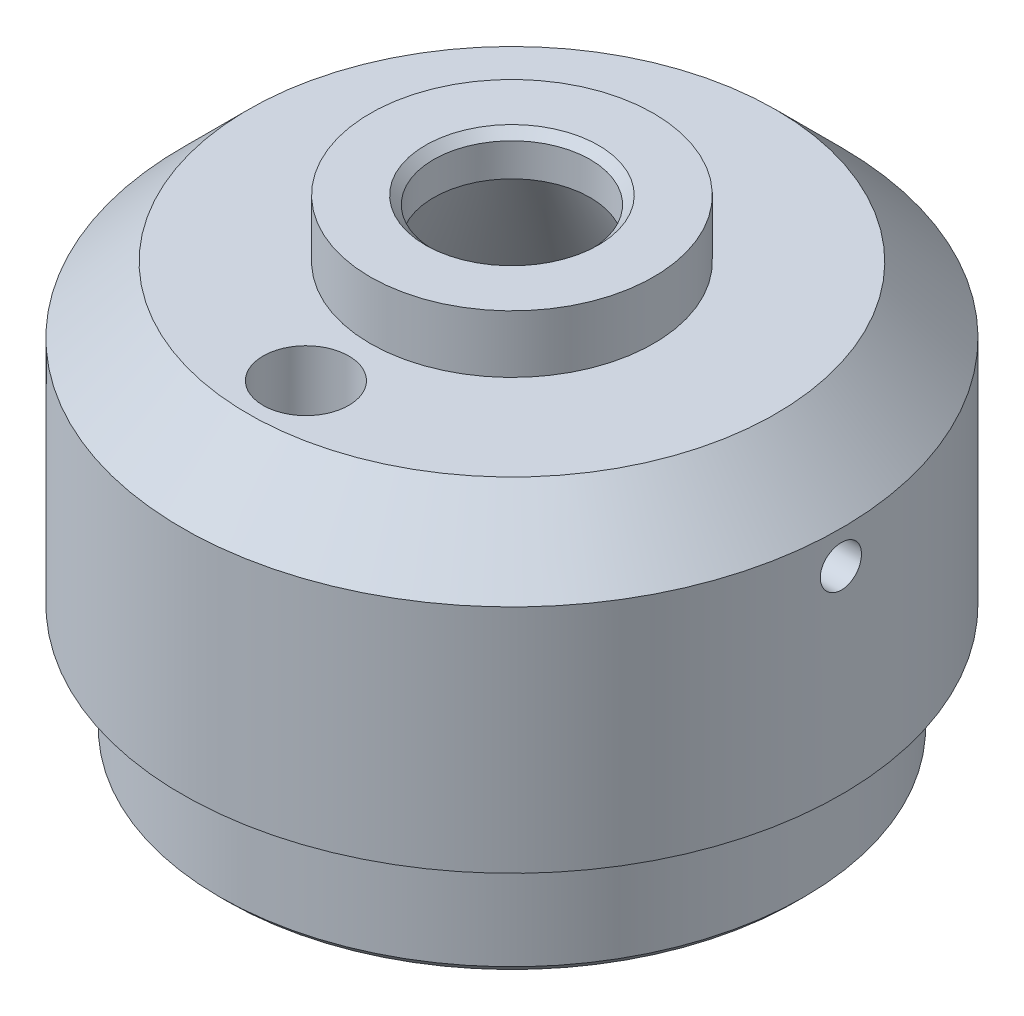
ISO-10303-21;
HEADER;
FILE_DESCRIPTION(('STEP AP214'),'2;1');
FILE_NAME('part.step','',(''),(''),'','','');
FILE_SCHEMA(('AUTOMOTIVE_DESIGN { 1 0 10303 214 1 1 1 1 }'));
ENDSEC;
DATA;
#1=APPLICATION_CONTEXT('core data for automotive mechanical design processes');
#2=APPLICATION_PROTOCOL_DEFINITION('international standard','automotive_design',2000,#1);
#3=PRODUCT_CONTEXT('',#1,'mechanical');
#4=PRODUCT('Part','Part','',(#3));
#5=PRODUCT_RELATED_PRODUCT_CATEGORY('part','',(#4));
#6=PRODUCT_DEFINITION_FORMATION('','',#4);
#7=PRODUCT_DEFINITION_CONTEXT('part definition',#1,'design');
#8=PRODUCT_DEFINITION('design','',#6,#7);
#9=PRODUCT_DEFINITION_SHAPE('','',#8);
#10=(LENGTH_UNIT() NAMED_UNIT(*) SI_UNIT(.MILLI.,.METRE.));
#11=(NAMED_UNIT(*) PLANE_ANGLE_UNIT() SI_UNIT($,.RADIAN.));
#12=(NAMED_UNIT(*) SI_UNIT($,.STERADIAN.) SOLID_ANGLE_UNIT());
#13=UNCERTAINTY_MEASURE_WITH_UNIT(LENGTH_MEASURE(1.E-05),#10,'distance_accuracy_value','');
#14=(GEOMETRIC_REPRESENTATION_CONTEXT(3) GLOBAL_UNCERTAINTY_ASSIGNED_CONTEXT((#13)) GLOBAL_UNIT_ASSIGNED_CONTEXT((#10,
#11,#12)) REPRESENTATION_CONTEXT('',''));
#15=CARTESIAN_POINT('',(0.,0.,0.));
#16=DIRECTION('',(0.,0.,1.));
#17=DIRECTION('',(1.,0.,0.));
#18=AXIS2_PLACEMENT_3D('',#15,#16,#17);
#19=CARTESIAN_POINT('',(0.,0.,0.));
#20=DIRECTION('',(0.,-1.,0.));
#21=DIRECTION('',(0.,0.,-1.));
#22=AXIS2_PLACEMENT_3D('',#19,#20,#21);
#23=CYLINDRICAL_SURFACE('',#22,17.75);
#24=CARTESIAN_POINT('',(0.,0.500000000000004,0.));
#25=DIRECTION('',(0.,-1.,0.));
#26=DIRECTION('',(0.,0.,-1.));
#27=AXIS2_PLACEMENT_3D('',#24,#25,#26);
#28=CIRCLE('',#27,17.75);
#29=CARTESIAN_POINT('',(0.,0.500000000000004,-17.75));
#30=VERTEX_POINT('',#29);
#31=EDGE_CURVE('E123',#30,#30,#28,.F.);
#32=ORIENTED_EDGE('',*,*,#31,.T.);
#33=EDGE_LOOP('',(#32));
#34=FACE_BOUND('',#33,.T.);
#35=CARTESIAN_POINT('',(0.,7.,0.));
#36=DIRECTION('',(0.,-1.,0.));
#37=DIRECTION('',(0.,0.,-1.));
#38=AXIS2_PLACEMENT_3D('',#35,#36,#37);
#39=CIRCLE('',#38,17.75);
#40=CARTESIAN_POINT('',(0.,7.,-17.75));
#41=VERTEX_POINT('',#40);
#42=EDGE_CURVE('E93',#41,#41,#39,.T.);
#43=ORIENTED_EDGE('',*,*,#42,.T.);
#44=EDGE_LOOP('',(#43));
#45=FACE_BOUND('',#44,.T.);
#46=ADVANCED_FACE('F36',(#34,#45),#23,.T.);
#47=CARTESIAN_POINT('',(16.25,0.,0.));
#48=DIRECTION('',(0.,-1.,0.));
#49=DIRECTION('',(0.,0.,-1.));
#50=AXIS2_PLACEMENT_3D('',#47,#48,#49);
#51=PLANE('',#50);
#52=CARTESIAN_POINT('',(0.,0.,0.));
#53=DIRECTION('',(0.,-1.,0.));
#54=DIRECTION('',(0.,0.,-1.));
#55=AXIS2_PLACEMENT_3D('',#52,#53,#54);
#56=CIRCLE('',#55,17.25);
#57=CARTESIAN_POINT('',(0.,0.,-17.25));
#58=VERTEX_POINT('',#57);
#59=EDGE_CURVE('E120',#58,#58,#56,.T.);
#60=ORIENTED_EDGE('',*,*,#59,.T.);
#61=EDGE_LOOP('',(#60));
#62=FACE_BOUND('',#61,.T.);
#63=CARTESIAN_POINT('',(0.,0.,0.));
#64=DIRECTION('',(0.,-1.,0.));
#65=DIRECTION('',(0.,0.,-1.));
#66=AXIS2_PLACEMENT_3D('',#63,#64,#65);
#67=CIRCLE('',#66,16.25);
#68=CARTESIAN_POINT('',(0.,0.,-16.25));
#69=VERTEX_POINT('',#68);
#70=EDGE_CURVE('E117',#69,#69,#67,.T.);
#71=ORIENTED_EDGE('',*,*,#70,.F.);
#72=EDGE_LOOP('',(#71));
#73=FACE_BOUND('',#72,.T.);
#74=ADVANCED_FACE('F170',(#62,#73),#51,.T.);
#75=CARTESIAN_POINT('',(0.,0.,0.));
#76=DIRECTION('',(0.,-1.,0.));
#77=DIRECTION('',(0.,0.,-1.));
#78=AXIS2_PLACEMENT_3D('',#75,#76,#77);
#79=CYLINDRICAL_SURFACE('',#78,16.25);
#80=ORIENTED_EDGE('',*,*,#70,.T.);
#81=EDGE_LOOP('',(#80));
#82=FACE_BOUND('',#81,.T.);
#83=CARTESIAN_POINT('',(0.,3.2,0.));
#84=DIRECTION('',(0.,-1.,0.));
#85=DIRECTION('',(0.,0.,-1.));
#86=AXIS2_PLACEMENT_3D('',#83,#84,#85);
#87=CIRCLE('',#86,16.25);
#88=CARTESIAN_POINT('',(0.,3.2,-16.25));
#89=VERTEX_POINT('',#88);
#90=EDGE_CURVE('E114',#89,#89,#87,.T.);
#91=ORIENTED_EDGE('',*,*,#90,.F.);
#92=EDGE_LOOP('',(#91));
#93=FACE_BOUND('',#92,.T.);
#94=ADVANCED_FACE('F175',(#82,#93),#79,.F.);
#95=CARTESIAN_POINT('',(0.,26.,0.));
#96=DIRECTION('',(0.,-1.,0.));
#97=DIRECTION('',(0.,0.,-1.));
#98=AXIS2_PLACEMENT_3D('',#95,#96,#97);
#99=CONICAL_SURFACE('',#98,4.75,0.467150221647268);
#100=CARTESIAN_POINT('',(0.,26.,0.));
#101=DIRECTION('',(0.,-1.,0.));
#102=DIRECTION('',(0.,0.,-1.));
#103=AXIS2_PLACEMENT_3D('',#100,#101,#102);
#104=CIRCLE('',#103,4.75);
#105=CARTESIAN_POINT('',(0.,26.,-4.75));
#106=VERTEX_POINT('',#105);
#107=EDGE_CURVE('E111',#106,#106,#104,.T.);
#108=CARTESIAN_POINT('',(0.,3.2,-16.25));
#109=CARTESIAN_POINT('',(0.,3.4375,-16.1302083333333));
#110=CARTESIAN_POINT('',(0.,3.675,-16.0104166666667));
#111=CARTESIAN_POINT('',(0.,4.15,-15.7708333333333));
#112=CARTESIAN_POINT('',(0.,4.3875,-15.6510416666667));
#113=CARTESIAN_POINT('',(0.,4.8625,-15.4114583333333));
#114=CARTESIAN_POINT('',(0.,5.1,-15.2916666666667));
#115=CARTESIAN_POINT('',(0.,5.575,-15.0520833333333));
#116=CARTESIAN_POINT('',(0.,5.8125,-14.9322916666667));
#117=CARTESIAN_POINT('',(0.,6.2875,-14.6927083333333));
#118=CARTESIAN_POINT('',(0.,6.525,-14.5729166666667));
#119=CARTESIAN_POINT('',(0.,7.,-14.3333333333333));
#120=CARTESIAN_POINT('',(0.,7.2375,-14.2135416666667));
#121=CARTESIAN_POINT('',(0.,7.7125,-13.9739583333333));
#122=CARTESIAN_POINT('',(0.,7.95,-13.8541666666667));
#123=CARTESIAN_POINT('',(0.,8.425,-13.6145833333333));
#124=CARTESIAN_POINT('',(0.,8.6625,-13.4947916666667));
#125=CARTESIAN_POINT('',(0.,9.1375,-13.2552083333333));
#126=CARTESIAN_POINT('',(0.,9.375,-13.1354166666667));
#127=CARTESIAN_POINT('',(0.,9.85,-12.8958333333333));
#128=CARTESIAN_POINT('',(0.,10.0875,-12.7760416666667));
#129=CARTESIAN_POINT('',(0.,10.5625,-12.5364583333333));
#130=CARTESIAN_POINT('',(0.,10.8,-12.4166666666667));
#131=CARTESIAN_POINT('',(0.,11.275,-12.1770833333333));
#132=CARTESIAN_POINT('',(0.,11.5125,-12.0572916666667));
#133=CARTESIAN_POINT('',(0.,11.9875,-11.8177083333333));
#134=CARTESIAN_POINT('',(0.,12.225,-11.6979166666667));
#135=CARTESIAN_POINT('',(0.,12.7,-11.4583333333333));
#136=CARTESIAN_POINT('',(0.,12.9375,-11.3385416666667));
#137=CARTESIAN_POINT('',(0.,13.4125,-11.0989583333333));
#138=CARTESIAN_POINT('',(0.,13.65,-10.9791666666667));
#139=CARTESIAN_POINT('',(0.,14.125,-10.7395833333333));
#140=CARTESIAN_POINT('',(0.,14.3625,-10.6197916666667));
#141=CARTESIAN_POINT('',(0.,14.8375,-10.3802083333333));
#142=CARTESIAN_POINT('',(0.,15.075,-10.2604166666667));
#143=CARTESIAN_POINT('',(0.,15.55,-10.0208333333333));
#144=CARTESIAN_POINT('',(0.,15.7875,-9.90104166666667));
#145=CARTESIAN_POINT('',(0.,16.2625,-9.66145833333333));
#146=CARTESIAN_POINT('',(0.,16.5,-9.54166666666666));
#147=CARTESIAN_POINT('',(0.,16.975,-9.30208333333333));
#148=CARTESIAN_POINT('',(0.,17.2125,-9.18229166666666));
#149=CARTESIAN_POINT('',(0.,17.6875,-8.94270833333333));
#150=CARTESIAN_POINT('',(0.,17.925,-8.82291666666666));
#151=CARTESIAN_POINT('',(0.,18.4,-8.58333333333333));
#152=CARTESIAN_POINT('',(0.,18.6375,-8.46354166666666));
#153=CARTESIAN_POINT('',(0.,19.1125,-8.22395833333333));
#154=CARTESIAN_POINT('',(0.,19.35,-8.10416666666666));
#155=CARTESIAN_POINT('',(0.,19.825,-7.86458333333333));
#156=CARTESIAN_POINT('',(0.,20.0625,-7.74479166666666));
#157=CARTESIAN_POINT('',(0.,20.5375,-7.50520833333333));
#158=CARTESIAN_POINT('',(0.,20.775,-7.38541666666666));
#159=CARTESIAN_POINT('',(0.,21.25,-7.14583333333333));
#160=CARTESIAN_POINT('',(0.,21.4875,-7.02604166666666));
#161=CARTESIAN_POINT('',(0.,21.9625,-6.78645833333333));
#162=CARTESIAN_POINT('',(0.,22.2,-6.66666666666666));
#163=CARTESIAN_POINT('',(0.,22.675,-6.42708333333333));
#164=CARTESIAN_POINT('',(0.,22.9125,-6.30729166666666));
#165=CARTESIAN_POINT('',(0.,23.3875,-6.06770833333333));
#166=CARTESIAN_POINT('',(0.,23.625,-5.94791666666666));
#167=CARTESIAN_POINT('',(0.,24.1,-5.70833333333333));
#168=CARTESIAN_POINT('',(0.,24.3375,-5.58854166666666));
#169=CARTESIAN_POINT('',(0.,24.8125,-5.34895833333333));
#170=CARTESIAN_POINT('',(0.,25.05,-5.22916666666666));
#171=CARTESIAN_POINT('',(0.,25.525,-4.98958333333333));
#172=CARTESIAN_POINT('',(0.,25.7625,-4.86979166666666));
#173=CARTESIAN_POINT('',(0.,26.,-4.75));
#174=B_SPLINE_CURVE_WITH_KNOTS('',3,(#108,#109,#110,#111,#112,#113,#114,#115,#116,#117,#118,
#119,#120,#121,#122,#123,#124,#125,#126,#127,#128,#129,#130,#131,#132,#133,#134,#135,#136,#137,
#138,#139,#140,#141,#142,#143,#144,#145,#146,#147,#148,#149,#150,#151,#152,#153,#154,#155,#156,
#157,#158,#159,#160,#161,#162,#163,#164,#165,#166,#167,#168,#169,#170,#171,#172,#173),
.UNSPECIFIED.,.F.,.F.,(4,2,2,2,2,2,2,2,2,2,2,2,2,2,2,2,2,2,2,2,2,2,2,2,2,2,2,2,2,2,2,2,4),(0.,
0.798001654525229,1.59600330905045,2.39400496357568,3.19200661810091,3.99000827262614,
4.78800992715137,5.58601158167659,6.38401323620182,7.18201489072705,7.98001654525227,
8.7780181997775,9.57601985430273,10.374021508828,11.1720231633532,11.9700248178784,
12.7680264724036,13.5660281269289,14.3640297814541,15.1620314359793,15.9600330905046,
16.7580347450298,17.556036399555,18.3540380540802,19.1520397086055,19.9500413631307,
20.7480430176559,21.5460446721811,22.3440463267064,23.1420479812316,23.9400496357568,
24.7380512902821,25.5360529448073),.UNSPECIFIED.);
#175=EDGE_CURVE('BSEAM187',#89,#106,#174,.T.);
#176=ORIENTED_EDGE('',*,*,#90,.T.);
#177=ORIENTED_EDGE('',*,*,#107,.F.);
#178=ORIENTED_EDGE('',*,*,#175,.T.);
#179=ORIENTED_EDGE('',*,*,#175,.F.);
#180=EDGE_LOOP('',(#176,#178,#177,#179));
#181=FACE_BOUND('',#180,.T.);
#182=ADVANCED_FACE('F187',(#181),#99,.F.);
#183=CARTESIAN_POINT('',(0.,0.,0.));
#184=DIRECTION('',(0.,-1.,0.));
#185=DIRECTION('',(0.,0.,-1.));
#186=AXIS2_PLACEMENT_3D('',#183,#184,#185);
#187=CYLINDRICAL_SURFACE('',#186,4.75);
#188=CARTESIAN_POINT('',(0.,28.,0.));
#189=DIRECTION('',(0.,1.,0.));
#190=DIRECTION('',(0.,0.,1.));
#191=AXIS2_PLACEMENT_3D('',#188,#189,#190);
#192=CIRCLE('',#191,4.75);
#193=CARTESIAN_POINT('',(0.,28.,4.75));
#194=VERTEX_POINT('',#193);
#195=EDGE_CURVE('E129',#194,#194,#192,.T.);
#196=ORIENTED_EDGE('',*,*,#195,.T.);
#197=EDGE_LOOP('',(#196));
#198=FACE_BOUND('',#197,.T.);
#199=ORIENTED_EDGE('',*,*,#107,.T.);
#200=EDGE_LOOP('',(#199));
#201=FACE_BOUND('',#200,.T.);
#202=ADVANCED_FACE('F193',(#198,#201),#187,.F.);
#203=CARTESIAN_POINT('',(8.59999999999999,28.5,0.));
#204=DIRECTION('',(0.,1.,0.));
#205=DIRECTION('',(0.,0.,1.));
#206=AXIS2_PLACEMENT_3D('',#203,#204,#205);
#207=PLANE('',#206);
#208=CARTESIAN_POINT('',(0.,28.5,0.));
#209=DIRECTION('',(0.,1.,0.));
#210=DIRECTION('',(0.,0.,1.));
#211=AXIS2_PLACEMENT_3D('',#208,#209,#210);
#212=CIRCLE('',#211,5.25000000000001);
#213=CARTESIAN_POINT('',(0.,28.5,5.25000000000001));
#214=VERTEX_POINT('',#213);
#215=EDGE_CURVE('E126',#214,#214,#212,.F.);
#216=ORIENTED_EDGE('',*,*,#215,.T.);
#217=EDGE_LOOP('',(#216));
#218=FACE_BOUND('',#217,.T.);
#219=CARTESIAN_POINT('',(0.,28.5,0.));
#220=DIRECTION('',(0.,-1.,0.));
#221=DIRECTION('',(0.,0.,-1.));
#222=AXIS2_PLACEMENT_3D('',#219,#220,#221);
#223=CIRCLE('',#222,8.6);
#224=CARTESIAN_POINT('',(0.,28.5,-8.6));
#225=VERTEX_POINT('',#224);
#226=EDGE_CURVE('E108',#225,#225,#223,.T.);
#227=ORIENTED_EDGE('',*,*,#226,.F.);
#228=EDGE_LOOP('',(#227));
#229=FACE_BOUND('',#228,.T.);
#230=ADVANCED_FACE('F198',(#218,#229),#207,.T.);
#231=CARTESIAN_POINT('',(0.,0.,0.));
#232=DIRECTION('',(0.,-1.,0.));
#233=DIRECTION('',(0.,0.,-1.));
#234=AXIS2_PLACEMENT_3D('',#231,#232,#233);
#235=CYLINDRICAL_SURFACE('',#234,8.6);
#236=ORIENTED_EDGE('',*,*,#226,.T.);
#237=EDGE_LOOP('',(#236));
#238=FACE_BOUND('',#237,.T.);
#239=CARTESIAN_POINT('',(0.,25.,0.));
#240=DIRECTION('',(0.,-1.,0.));
#241=DIRECTION('',(0.,0.,-1.));
#242=AXIS2_PLACEMENT_3D('',#239,#240,#241);
#243=CIRCLE('',#242,8.6);
#244=CARTESIAN_POINT('',(0.,25.,-8.6));
#245=VERTEX_POINT('',#244);
#246=EDGE_CURVE('E105',#245,#245,#243,.T.);
#247=ORIENTED_EDGE('',*,*,#246,.F.);
#248=EDGE_LOOP('',(#247));
#249=FACE_BOUND('',#248,.T.);
#250=ADVANCED_FACE('F204',(#238,#249),#235,.T.);
#251=CARTESIAN_POINT('',(16.,25.,0.));
#252=DIRECTION('',(0.,1.,0.));
#253=DIRECTION('',(0.,0.,1.));
#254=AXIS2_PLACEMENT_3D('',#251,#252,#253);
#255=PLANE('',#254);
#256=CARTESIAN_POINT('',(0.,25.,12.5));
#257=DIRECTION('',(0.,1.,0.));
#258=DIRECTION('',(0.,0.,1.));
#259=AXIS2_PLACEMENT_3D('',#256,#257,#258);
#260=CIRCLE('',#259,2.6);
#261=CARTESIAN_POINT('',(0.,25.,15.1));
#262=VERTEX_POINT('',#261);
#263=EDGE_CURVE('E90',#262,#262,#260,.T.);
#264=ORIENTED_EDGE('',*,*,#263,.F.);
#265=EDGE_LOOP('',(#264));
#266=FACE_BOUND('',#265,.T.);
#267=ORIENTED_EDGE('',*,*,#246,.T.);
#268=EDGE_LOOP('',(#267));
#269=FACE_BOUND('',#268,.T.);
#270=CARTESIAN_POINT('',(0.,25.,0.));
#271=DIRECTION('',(0.,-1.,0.));
#272=DIRECTION('',(0.,0.,-1.));
#273=AXIS2_PLACEMENT_3D('',#270,#271,#272);
#274=CIRCLE('',#273,16.);
#275=CARTESIAN_POINT('',(0.,25.,-16.));
#276=VERTEX_POINT('',#275);
#277=EDGE_CURVE('E102',#276,#276,#274,.T.);
#278=ORIENTED_EDGE('',*,*,#277,.F.);
#279=EDGE_LOOP('',(#278));
#280=FACE_BOUND('',#279,.T.);
#281=ADVANCED_FACE('F210',(#266,#269,#280),#255,.T.);
#282=CARTESIAN_POINT('',(0.,21.,0.));
#283=DIRECTION('',(0.,-1.,0.));
#284=DIRECTION('',(0.,0.,-1.));
#285=AXIS2_PLACEMENT_3D('',#282,#283,#284);
#286=CONICAL_SURFACE('',#285,20.,0.785398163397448);
#287=ORIENTED_EDGE('',*,*,#277,.T.);
#288=EDGE_LOOP('',(#287));
#289=FACE_BOUND('',#288,.T.);
#290=CARTESIAN_POINT('',(0.,21.,0.));
#291=DIRECTION('',(0.,-1.,0.));
#292=DIRECTION('',(0.,0.,-1.));
#293=AXIS2_PLACEMENT_3D('',#290,#291,#292);
#294=CIRCLE('',#293,20.);
#295=CARTESIAN_POINT('',(0.,21.,-20.));
#296=VERTEX_POINT('',#295);
#297=EDGE_CURVE('E99',#296,#296,#294,.T.);
#298=ORIENTED_EDGE('',*,*,#297,.F.);
#299=EDGE_LOOP('',(#298));
#300=FACE_BOUND('',#299,.T.);
#301=ADVANCED_FACE('F166',(#289,#300),#286,.T.);
#302=CARTESIAN_POINT('',(0.,0.,0.));
#303=DIRECTION('',(0.,-1.,0.));
#304=DIRECTION('',(0.,0.,-1.));
#305=AXIS2_PLACEMENT_3D('',#302,#303,#304);
#306=CYLINDRICAL_SURFACE('',#305,20.);
#307=CARTESIAN_POINT('',(-19.9608992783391,19.,1.24999999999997));
#308=CARTESIAN_POINT('',(-19.9608998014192,19.0701394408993,1.24999691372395));
#309=CARTESIAN_POINT('',(-19.96127294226,19.14032799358,1.24407671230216));
#310=CARTESIAN_POINT('',(-19.9627253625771,19.2787670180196,1.22054483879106));
#311=CARTESIAN_POINT('',(-19.9638054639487,19.3470151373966,1.20291955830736));
#312=CARTESIAN_POINT('',(-19.9665489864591,19.4795479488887,1.15648576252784));
#313=CARTESIAN_POINT('',(-19.9682120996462,19.5438347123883,1.12768315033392));
#314=CARTESIAN_POINT('',(-19.9719338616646,19.6666442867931,1.05972184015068));
#315=CARTESIAN_POINT('',(-19.9739924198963,19.7251684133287,1.02056551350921));
#316=CARTESIAN_POINT('',(-19.9782766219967,19.8348962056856,0.932943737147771));
#317=CARTESIAN_POINT('',(-19.9805024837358,19.8860900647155,0.884466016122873));
#318=CARTESIAN_POINT('',(-19.9848684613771,19.9796201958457,0.779602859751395));
#319=CARTESIAN_POINT('',(-19.9870085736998,20.021956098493,0.723217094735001));
#320=CARTESIAN_POINT('',(-19.9909637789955,20.0965984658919,0.6040833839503));
#321=CARTESIAN_POINT('',(-19.9927786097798,20.1288968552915,0.54133036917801));
#322=CARTESIAN_POINT('',(-19.9958764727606,20.1824956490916,0.411279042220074));
#323=CARTESIAN_POINT('',(-19.9971595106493,20.2037961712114,0.343980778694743));
#324=CARTESIAN_POINT('',(-19.9990477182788,20.234767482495,0.206843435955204));
#325=CARTESIAN_POINT('',(-19.9996537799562,20.2444535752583,0.137007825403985));
#326=CARTESIAN_POINT('',(-20.0001227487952,20.2519683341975,-0.00330049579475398));
#327=CARTESIAN_POINT('',(-19.9999856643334,20.2497971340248,-0.0737731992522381));
#328=CARTESIAN_POINT('',(-19.9989845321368,20.2336715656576,-0.213251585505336));
#329=CARTESIAN_POINT('',(-19.9981215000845,20.2197336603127,-0.282259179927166));
#330=CARTESIAN_POINT('',(-19.9957668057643,20.1804958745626,-0.416953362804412));
#331=CARTESIAN_POINT('',(-19.9942751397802,20.1551959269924,-0.482639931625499));
#332=CARTESIAN_POINT('',(-19.9908293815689,20.0939335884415,-0.608880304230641));
#333=CARTESIAN_POINT('',(-19.9888749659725,20.0579637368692,-0.669430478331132));
#334=CARTESIAN_POINT('',(-19.9847236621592,19.9763880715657,-0.783639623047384));
#335=CARTESIAN_POINT('',(-19.982526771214,19.9307821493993,-0.837298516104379));
#336=CARTESIAN_POINT('',(-19.9781333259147,19.8311359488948,-0.936298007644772));
#337=CARTESIAN_POINT('',(-19.9759367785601,19.7770813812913,-0.981624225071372));
#338=CARTESIAN_POINT('',(-19.9717954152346,19.662122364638,-1.06256083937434));
#339=CARTESIAN_POINT('',(-19.9698505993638,19.6012179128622,-1.09817123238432));
#340=CARTESIAN_POINT('',(-19.9664323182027,19.4742788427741,-1.15866432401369));
#341=CARTESIAN_POINT('',(-19.9649588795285,19.4082439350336,-1.18354641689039));
#342=CARTESIAN_POINT('',(-19.9626504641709,19.2729226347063,-1.22186666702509));
#343=CARTESIAN_POINT('',(-19.9618154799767,19.2036362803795,-1.23530495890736));
#344=CARTESIAN_POINT('',(-19.9608795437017,19.0639043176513,-1.25033822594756));
#345=CARTESIAN_POINT('',(-19.9607773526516,18.9934608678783,-1.25195319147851));
#346=CARTESIAN_POINT('',(-19.9613152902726,18.8533040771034,-1.2433461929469));
#347=CARTESIAN_POINT('',(-19.961955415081,18.7835907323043,-1.23312429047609));
#348=CARTESIAN_POINT('',(-19.9639047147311,18.6469295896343,-1.20115032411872));
#349=CARTESIAN_POINT('',(-19.9652133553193,18.5799796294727,-1.17940746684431));
#350=CARTESIAN_POINT('',(-19.9683517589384,18.4506789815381,-1.12501811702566));
#351=CARTESIAN_POINT('',(-19.9701815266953,18.3883283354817,-1.09237152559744));
#352=CARTESIAN_POINT('',(-19.9741589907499,18.2699043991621,-1.01705034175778));
#353=CARTESIAN_POINT('',(-19.9763071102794,18.2138396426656,-0.974362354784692));
#354=CARTESIAN_POINT('',(-19.9806777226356,18.1096649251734,-0.880189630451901));
#355=CARTESIAN_POINT('',(-19.9829002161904,18.0615550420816,-0.828704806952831));
#356=CARTESIAN_POINT('',(-19.9871727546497,17.9745882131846,-0.718313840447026));
#357=CARTESIAN_POINT('',(-19.9892225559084,17.9357442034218,-0.659397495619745));
#358=CARTESIAN_POINT('',(-19.9929152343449,17.8685002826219,-0.535867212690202));
#359=CARTESIAN_POINT('',(-19.9945581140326,17.8401003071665,-0.471253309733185));
#360=CARTESIAN_POINT('',(-19.9972506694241,17.794573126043,-0.338209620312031));
#361=CARTESIAN_POINT('',(-19.9983007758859,17.7774377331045,-0.269782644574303));
#362=CARTESIAN_POINT('',(-19.9996911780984,17.7548993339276,-0.131016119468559));
#363=CARTESIAN_POINT('',(-20.0000314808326,17.7494962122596,-0.0606765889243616));
#364=CARTESIAN_POINT('',(-19.9999639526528,17.7505768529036,0.0797903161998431));
#365=CARTESIAN_POINT('',(-19.9995573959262,17.757040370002,0.149917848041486));
#366=CARTESIAN_POINT('',(-19.9980443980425,17.7816288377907,0.288089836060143));
#367=CARTESIAN_POINT('',(-19.9969379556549,17.7997538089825,0.356134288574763));
#368=CARTESIAN_POINT('',(-19.994149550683,17.8471461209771,0.488211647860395));
#369=CARTESIAN_POINT('',(-19.9924675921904,17.8764133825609,0.552244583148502));
#370=CARTESIAN_POINT('',(-19.988717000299,17.9452566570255,0.674490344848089));
#371=CARTESIAN_POINT('',(-19.9866483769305,17.9848324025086,0.732703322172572));
#372=CARTESIAN_POINT('',(-19.982352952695,18.0732439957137,0.841759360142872));
#373=CARTESIAN_POINT('',(-19.9801259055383,18.1220944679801,0.89259055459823));
#374=CARTESIAN_POINT('',(-19.9757665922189,18.2276494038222,0.985348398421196));
#375=CARTESIAN_POINT('',(-19.9736343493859,18.2843557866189,1.02727286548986));
#376=CARTESIAN_POINT('',(-19.9697031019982,18.404077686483,1.10105823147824));
#377=CARTESIAN_POINT('',(-19.9679045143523,18.4671009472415,1.13290657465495));
#378=CARTESIAN_POINT('',(-19.9648495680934,18.5975656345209,1.18553070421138));
#379=CARTESIAN_POINT('',(-19.963592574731,18.6650017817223,1.20631945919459));
#380=CARTESIAN_POINT('',(-19.9620925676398,18.777375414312,1.23083110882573));
#381=CARTESIAN_POINT('',(-19.9616470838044,18.8215865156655,1.23801014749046));
#382=CARTESIAN_POINT('',(-19.9610502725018,18.9105250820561,1.24759557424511));
#383=CARTESIAN_POINT('',(-19.9608989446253,18.9552525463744,1.25000196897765));
#384=CARTESIAN_POINT('',(-19.9608992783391,19.,1.24999999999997));
#385=B_SPLINE_CURVE_WITH_KNOTS('',3,(#307,#308,#309,#310,#311,#312,#313,#314,#315,#316,#317,
#318,#319,#320,#321,#322,#323,#324,#325,#326,#327,#328,#329,#330,#331,#332,#333,#334,#335,#336,
#337,#338,#339,#340,#341,#342,#343,#344,#345,#346,#347,#348,#349,#350,#351,#352,#353,#354,#355,
#356,#357,#358,#359,#360,#361,#362,#363,#364,#365,#366,#367,#368,#369,#370,#371,#372,#373,#374,
#375,#376,#377,#378,#379,#380,#381,#382,#383,#384),.UNSPECIFIED.,.T.,.F.,(4,2,2,2,2,2,2,2,2,2,2,
2,2,2,2,2,2,2,2,2,2,2,2,2,2,2,2,2,2,2,2,2,2,2,2,2,2,2,4),(0.,0.210254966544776,
0.420754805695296,0.631143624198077,0.841484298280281,1.05210379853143,1.2627320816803,
1.47352938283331,1.68432442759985,1.8948414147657,2.1053560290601,2.31557659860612,
2.52579841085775,2.73616756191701,2.94653908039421,3.15727033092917,3.36800166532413,
3.57874489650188,3.78948564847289,3.99987000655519,4.21025326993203,4.42046866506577,
4.63068596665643,4.84118529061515,5.05168667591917,5.26248024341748,5.47327251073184,
5.68391140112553,5.89454821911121,6.1048260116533,6.31510417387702,6.52538084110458,
6.73565205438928,6.94625762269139,7.15691473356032,7.3678333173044,7.57850402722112,
7.71264235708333,7.84678050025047),.UNSPECIFIED.);
#386=CARTESIAN_POINT('',(-20.,20.25,0.));
#387=VERTEX_POINT('',#386);
#388=CARTESIAN_POINT('',(-20.,17.75,0.));
#389=VERTEX_POINT('',#388);
#390=EDGE_CURVE('E13',#387,#389,#385,.T.);
#391=ORIENTED_EDGE('',*,*,#390,.F.);
#392=EDGE_CURVE('E39',#389,#387,#385,.T.);
#393=ORIENTED_EDGE('',*,*,#392,.F.);
#394=EDGE_LOOP('',(#391,#393));
#395=FACE_BOUND('',#394,.T.);
#396=CARTESIAN_POINT('',(19.9608992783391,19.,-1.24999999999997));
#397=CARTESIAN_POINT('',(19.9608998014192,19.0701394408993,-1.24999691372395));
#398=CARTESIAN_POINT('',(19.96127294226,19.14032799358,-1.24407671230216));
#399=CARTESIAN_POINT('',(19.9627253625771,19.2787670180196,-1.22054483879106));
#400=CARTESIAN_POINT('',(19.9638054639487,19.3470151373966,-1.20291955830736));
#401=CARTESIAN_POINT('',(19.9665489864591,19.4795479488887,-1.15648576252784));
#402=CARTESIAN_POINT('',(19.9682120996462,19.5438347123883,-1.12768315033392));
#403=CARTESIAN_POINT('',(19.9719338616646,19.6666442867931,-1.05972184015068));
#404=CARTESIAN_POINT('',(19.9739924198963,19.7251684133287,-1.02056551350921));
#405=CARTESIAN_POINT('',(19.9782766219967,19.8348962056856,-0.932943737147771));
#406=CARTESIAN_POINT('',(19.9805024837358,19.8860900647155,-0.884466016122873));
#407=CARTESIAN_POINT('',(19.9848684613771,19.9796201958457,-0.779602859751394));
#408=CARTESIAN_POINT('',(19.9870085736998,20.021956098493,-0.723217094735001));
#409=CARTESIAN_POINT('',(19.9909637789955,20.0965984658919,-0.6040833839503));
#410=CARTESIAN_POINT('',(19.9927786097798,20.1288968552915,-0.54133036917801));
#411=CARTESIAN_POINT('',(19.9958764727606,20.1824956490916,-0.411279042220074));
#412=CARTESIAN_POINT('',(19.9971595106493,20.2037961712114,-0.343980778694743));
#413=CARTESIAN_POINT('',(19.9990477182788,20.234767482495,-0.206843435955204));
#414=CARTESIAN_POINT('',(19.9996537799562,20.2444535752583,-0.137007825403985));
#415=CARTESIAN_POINT('',(20.0001227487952,20.2519683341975,0.00330049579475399));
#416=CARTESIAN_POINT('',(19.9999856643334,20.2497971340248,0.0737731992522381));
#417=CARTESIAN_POINT('',(19.9989845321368,20.2336715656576,0.213251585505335));
#418=CARTESIAN_POINT('',(19.9981215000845,20.2197336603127,0.282259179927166));
#419=CARTESIAN_POINT('',(19.9957668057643,20.1804958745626,0.416953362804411));
#420=CARTESIAN_POINT('',(19.9942751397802,20.1551959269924,0.482639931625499));
#421=CARTESIAN_POINT('',(19.990829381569,20.0939335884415,0.608880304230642));
#422=CARTESIAN_POINT('',(19.9888749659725,20.0579637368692,0.669430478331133));
#423=CARTESIAN_POINT('',(19.9847236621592,19.9763880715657,0.783639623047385));
#424=CARTESIAN_POINT('',(19.982526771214,19.9307821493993,0.837298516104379));
#425=CARTESIAN_POINT('',(19.9781333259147,19.8311359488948,0.936298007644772));
#426=CARTESIAN_POINT('',(19.9759367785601,19.7770813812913,0.981624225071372));
#427=CARTESIAN_POINT('',(19.9717954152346,19.662122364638,1.06256083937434));
#428=CARTESIAN_POINT('',(19.9698505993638,19.6012179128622,1.09817123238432));
#429=CARTESIAN_POINT('',(19.9664323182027,19.4742788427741,1.15866432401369));
#430=CARTESIAN_POINT('',(19.9649588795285,19.4082439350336,1.18354641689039));
#431=CARTESIAN_POINT('',(19.9626504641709,19.2729226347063,1.22186666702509));
#432=CARTESIAN_POINT('',(19.9618154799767,19.2036362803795,1.23530495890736));
#433=CARTESIAN_POINT('',(19.9608795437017,19.0639043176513,1.25033822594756));
#434=CARTESIAN_POINT('',(19.9607773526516,18.9934608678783,1.25195319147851));
#435=CARTESIAN_POINT('',(19.9613152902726,18.8533040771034,1.2433461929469));
#436=CARTESIAN_POINT('',(19.961955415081,18.7835907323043,1.23312429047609));
#437=CARTESIAN_POINT('',(19.9639047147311,18.6469295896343,1.20115032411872));
#438=CARTESIAN_POINT('',(19.9652133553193,18.5799796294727,1.17940746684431));
#439=CARTESIAN_POINT('',(19.9683517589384,18.4506789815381,1.12501811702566));
#440=CARTESIAN_POINT('',(19.9701815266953,18.3883283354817,1.09237152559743));
#441=CARTESIAN_POINT('',(19.9741589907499,18.2699043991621,1.01705034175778));
#442=CARTESIAN_POINT('',(19.9763071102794,18.2138396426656,0.974362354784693));
#443=CARTESIAN_POINT('',(19.9806777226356,18.1096649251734,0.880189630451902));
#444=CARTESIAN_POINT('',(19.9829002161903,18.0615550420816,0.82870480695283));
#445=CARTESIAN_POINT('',(19.9871727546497,17.9745882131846,0.718313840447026));
#446=CARTESIAN_POINT('',(19.9892225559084,17.9357442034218,0.659397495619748));
#447=CARTESIAN_POINT('',(19.9929152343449,17.8685002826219,0.535867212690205));
#448=CARTESIAN_POINT('',(19.9945581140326,17.8401003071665,0.471253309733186));
#449=CARTESIAN_POINT('',(19.9972506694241,17.794573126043,0.33820962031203));
#450=CARTESIAN_POINT('',(19.9983007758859,17.7774377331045,0.269782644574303));
#451=CARTESIAN_POINT('',(19.9996911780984,17.7548993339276,0.13101611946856));
#452=CARTESIAN_POINT('',(20.0000314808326,17.7494962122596,0.0606765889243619));
#453=CARTESIAN_POINT('',(19.9999639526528,17.7505768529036,-0.0797903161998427));
#454=CARTESIAN_POINT('',(19.9995573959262,17.757040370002,-0.149917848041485));
#455=CARTESIAN_POINT('',(19.9980443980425,17.7816288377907,-0.288089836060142));
#456=CARTESIAN_POINT('',(19.9969379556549,17.7997538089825,-0.356134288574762));
#457=CARTESIAN_POINT('',(19.994149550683,17.8471461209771,-0.488211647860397));
#458=CARTESIAN_POINT('',(19.9924675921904,17.8764133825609,-0.552244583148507));
#459=CARTESIAN_POINT('',(19.988717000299,17.9452566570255,-0.674490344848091));
#460=CARTESIAN_POINT('',(19.9866483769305,17.9848324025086,-0.732703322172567));
#461=CARTESIAN_POINT('',(19.9823529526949,18.0732439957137,-0.841759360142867));
#462=CARTESIAN_POINT('',(19.9801259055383,18.1220944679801,-0.892590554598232));
#463=CARTESIAN_POINT('',(19.9757665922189,18.2276494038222,-0.985348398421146));
#464=CARTESIAN_POINT('',(19.9736343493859,18.2843557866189,-1.02727286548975));
#465=CARTESIAN_POINT('',(19.9697031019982,18.404077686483,-1.10105823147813));
#466=CARTESIAN_POINT('',(19.9679045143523,18.4671009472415,-1.13290657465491));
#467=CARTESIAN_POINT('',(19.9648495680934,18.5975656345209,-1.1855307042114));
#468=CARTESIAN_POINT('',(19.963592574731,18.6650017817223,-1.2063194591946));
#469=CARTESIAN_POINT('',(19.9620925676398,18.777375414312,-1.23083110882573));
#470=CARTESIAN_POINT('',(19.9616470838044,18.8215865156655,-1.23801014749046));
#471=CARTESIAN_POINT('',(19.9610502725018,18.9105250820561,-1.24759557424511));
#472=CARTESIAN_POINT('',(19.9608989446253,18.9552525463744,-1.25000196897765));
#473=CARTESIAN_POINT('',(19.9608992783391,19.,-1.24999999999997));
#474=B_SPLINE_CURVE_WITH_KNOTS('',3,(#396,#397,#398,#399,#400,#401,#402,#403,#404,#405,#406,
#407,#408,#409,#410,#411,#412,#413,#414,#415,#416,#417,#418,#419,#420,#421,#422,#423,#424,#425,
#426,#427,#428,#429,#430,#431,#432,#433,#434,#435,#436,#437,#438,#439,#440,#441,#442,#443,#444,
#445,#446,#447,#448,#449,#450,#451,#452,#453,#454,#455,#456,#457,#458,#459,#460,#461,#462,#463,
#464,#465,#466,#467,#468,#469,#470,#471,#472,#473),.UNSPECIFIED.,.T.,.F.,(4,2,2,2,2,2,2,2,2,2,2,
2,2,2,2,2,2,2,2,2,2,2,2,2,2,2,2,2,2,2,2,2,2,2,2,2,2,2,4),(0.,0.210254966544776,
0.420754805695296,0.631143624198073,0.841484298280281,1.05210379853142,1.2627320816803,
1.47352938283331,1.68432442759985,1.8948414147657,2.1053560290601,2.31557659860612,
2.52579841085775,2.73616756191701,2.94653908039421,3.15727033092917,3.36800166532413,
3.57874489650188,3.78948564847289,3.99987000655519,4.21025326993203,4.42046866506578,
4.63068596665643,4.84118529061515,5.05168667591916,5.26248024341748,5.47327251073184,
5.68391140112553,5.89454821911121,6.1048260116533,6.31510417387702,6.52538084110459,
6.73565205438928,6.94625762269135,7.15691473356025,7.36783331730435,7.5785040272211,
7.71264235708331,7.84678050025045),.UNSPECIFIED.);
#475=CARTESIAN_POINT('',(20.,20.25,0.));
#476=VERTEX_POINT('',#475);
#477=CARTESIAN_POINT('',(20.,17.75,0.));
#478=VERTEX_POINT('',#477);
#479=EDGE_CURVE('E58',#476,#478,#474,.T.);
#480=ORIENTED_EDGE('',*,*,#479,.F.);
#481=EDGE_CURVE('E131',#478,#476,#474,.T.);
#482=ORIENTED_EDGE('',*,*,#481,.F.);
#483=EDGE_LOOP('',(#480,#482));
#484=FACE_BOUND('',#483,.T.);
#485=ORIENTED_EDGE('',*,*,#297,.T.);
#486=EDGE_LOOP('',(#485));
#487=FACE_BOUND('',#486,.T.);
#488=CARTESIAN_POINT('',(0.,7.,0.));
#489=DIRECTION('',(0.,-1.,0.));
#490=DIRECTION('',(0.,0.,-1.));
#491=AXIS2_PLACEMENT_3D('',#488,#489,#490);
#492=CIRCLE('',#491,20.);
#493=CARTESIAN_POINT('',(0.,7.,-20.));
#494=VERTEX_POINT('',#493);
#495=EDGE_CURVE('E96',#494,#494,#492,.T.);
#496=ORIENTED_EDGE('',*,*,#495,.F.);
#497=EDGE_LOOP('',(#496));
#498=FACE_BOUND('',#497,.T.);
#499=ADVANCED_FACE('F135',(#395,#484,#487,#498),#306,.T.);
#500=CARTESIAN_POINT('',(17.75,7.,0.));
#501=DIRECTION('',(0.,-1.,0.));
#502=DIRECTION('',(0.,0.,-1.));
#503=AXIS2_PLACEMENT_3D('',#500,#501,#502);
#504=PLANE('',#503);
#505=ORIENTED_EDGE('',*,*,#495,.T.);
#506=EDGE_LOOP('',(#505));
#507=FACE_BOUND('',#506,.T.);
#508=ORIENTED_EDGE('',*,*,#42,.F.);
#509=EDGE_LOOP('',(#508));
#510=FACE_BOUND('',#509,.T.);
#511=ADVANCED_FACE('F159',(#507,#510),#504,.T.);
#512=CARTESIAN_POINT('',(0.,0.,0.));
#513=DIRECTION('',(0.,1.,0.));
#514=DIRECTION('',(0.,0.,1.));
#515=AXIS2_PLACEMENT_3D('',#512,#513,#514);
#516=CONICAL_SURFACE('',#515,17.25,0.785398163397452);
#517=ORIENTED_EDGE('',*,*,#31,.F.);
#518=EDGE_LOOP('',(#517));
#519=FACE_BOUND('',#518,.T.);
#520=ORIENTED_EDGE('',*,*,#59,.F.);
#521=EDGE_LOOP('',(#520));
#522=FACE_BOUND('',#521,.T.);
#523=ADVANCED_FACE('F156',(#519,#522),#516,.T.);
#524=CARTESIAN_POINT('',(0.,28.5,0.));
#525=DIRECTION('',(0.,1.,0.));
#526=DIRECTION('',(0.,0.,1.));
#527=AXIS2_PLACEMENT_3D('',#524,#525,#526);
#528=CONICAL_SURFACE('',#527,5.25000000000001,0.785398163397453);
#529=ORIENTED_EDGE('',*,*,#195,.F.);
#530=EDGE_LOOP('',(#529));
#531=FACE_BOUND('',#530,.T.);
#532=ORIENTED_EDGE('',*,*,#215,.F.);
#533=EDGE_LOOP('',(#532));
#534=FACE_BOUND('',#533,.T.);
#535=ADVANCED_FACE('F152',(#531,#534),#528,.F.);
#536=CARTESIAN_POINT('',(0.,20.,12.5));
#537=DIRECTION('',(0.,1.,0.));
#538=DIRECTION('',(0.,0.,1.));
#539=AXIS2_PLACEMENT_3D('',#536,#537,#538);
#540=CYLINDRICAL_SURFACE('',#539,2.6);
#541=CARTESIAN_POINT('',(0.,20.,12.5));
#542=DIRECTION('',(0.,-1.,0.));
#543=DIRECTION('',(0.,0.,-1.));
#544=AXIS2_PLACEMENT_3D('',#541,#542,#543);
#545=CIRCLE('',#544,2.6);
#546=CARTESIAN_POINT('',(0.,20.,9.89999999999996));
#547=VERTEX_POINT('',#546);
#548=EDGE_CURVE('E85',#547,#547,#545,.T.);
#549=ORIENTED_EDGE('',*,*,#548,.T.);
#550=EDGE_LOOP('',(#549));
#551=FACE_BOUND('',#550,.T.);
#552=ORIENTED_EDGE('',*,*,#263,.T.);
#553=EDGE_LOOP('',(#552));
#554=FACE_BOUND('',#553,.T.);
#555=ADVANCED_FACE('F148',(#551,#554),#540,.F.);
#556=CARTESIAN_POINT('',(0.,18.498889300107,12.5));
#557=DIRECTION('',(0.,1.,0.));
#558=DIRECTION('',(0.,0.,1.));
#559=AXIS2_PLACEMENT_3D('',#556,#557,#558);
#560=CONICAL_SURFACE('',#559,0.,1.0471975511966);
#561=ORIENTED_EDGE('',*,*,#548,.F.);
#562=EDGE_LOOP('',(#561));
#563=FACE_BOUND('',#562,.T.);
#564=CARTESIAN_POINT('',(0.,18.498889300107,12.5));
#565=VERTEX_POINT('',#564);
#566=VERTEX_LOOP('',#565);
#567=FACE_BOUND('',#566,.T.);
#568=ADVANCED_FACE('F145',(#563,#567),#560,.F.);
#569=CARTESIAN_POINT('',(20.,19.,0.));
#570=DIRECTION('',(1.,0.,0.));
#571=DIRECTION('',(0.,0.,-1.));
#572=AXIS2_PLACEMENT_3D('',#569,#570,#571);
#573=CYLINDRICAL_SURFACE('',#572,1.24999999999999);
#574=ORIENTED_EDGE('',*,*,#479,.T.);
#575=ORIENTED_EDGE('',*,*,#481,.T.);
#576=EDGE_LOOP('',(#574,#575));
#577=FACE_BOUND('',#576,.T.);
#578=CARTESIAN_POINT('',(14.5,19.,0.));
#579=DIRECTION('',(1.,0.,0.));
#580=DIRECTION('',(0.,0.,-1.));
#581=AXIS2_PLACEMENT_3D('',#578,#579,#580);
#582=CIRCLE('',#581,1.24999999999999);
#583=CARTESIAN_POINT('',(14.5,19.,-1.24999999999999));
#584=VERTEX_POINT('',#583);
#585=EDGE_CURVE('E82',#584,#584,#582,.T.);
#586=ORIENTED_EDGE('',*,*,#585,.F.);
#587=EDGE_LOOP('',(#586));
#588=FACE_BOUND('',#587,.T.);
#589=ADVANCED_FACE('F139',(#577,#588),#573,.F.);
#590=CARTESIAN_POINT('',(14.5,19.,0.));
#591=DIRECTION('',(1.,0.,0.));
#592=DIRECTION('',(0.,0.,-1.));
#593=AXIS2_PLACEMENT_3D('',#590,#591,#592);
#594=CONICAL_SURFACE('',#593,1.24999999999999,1.02974425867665);
#595=CARTESIAN_POINT('',(13.7489242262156,19.,0.));
#596=VERTEX_POINT('',#595);
#597=VERTEX_LOOP('',#596);
#598=FACE_BOUND('',#597,.T.);
#599=ORIENTED_EDGE('',*,*,#585,.T.);
#600=EDGE_LOOP('',(#599));
#601=FACE_BOUND('',#600,.T.);
#602=ADVANCED_FACE('F144',(#598,#601),#594,.F.);
#603=CARTESIAN_POINT('',(-20.,19.,0.));
#604=DIRECTION('',(-1.,0.,0.));
#605=DIRECTION('',(0.,0.,1.));
#606=AXIS2_PLACEMENT_3D('',#603,#604,#605);
#607=CYLINDRICAL_SURFACE('',#606,1.24999999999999);
#608=ORIENTED_EDGE('',*,*,#390,.T.);
#609=ORIENTED_EDGE('',*,*,#392,.T.);
#610=EDGE_LOOP('',(#608,#609));
#611=FACE_BOUND('',#610,.T.);
#612=CARTESIAN_POINT('',(-14.5,19.,0.));
#613=DIRECTION('',(-1.,0.,0.));
#614=DIRECTION('',(0.,0.,1.));
#615=AXIS2_PLACEMENT_3D('',#612,#613,#614);
#616=CIRCLE('',#615,1.24999999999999);
#617=CARTESIAN_POINT('',(-14.5,19.,1.24999999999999));
#618=VERTEX_POINT('',#617);
#619=EDGE_CURVE('E80',#618,#618,#616,.T.);
#620=ORIENTED_EDGE('',*,*,#619,.F.);
#621=EDGE_LOOP('',(#620));
#622=FACE_BOUND('',#621,.T.);
#623=ADVANCED_FACE('F76',(#611,#622),#607,.F.);
#624=CARTESIAN_POINT('',(-14.5,19.,0.));
#625=DIRECTION('',(-1.,0.,0.));
#626=DIRECTION('',(0.,0.,1.));
#627=AXIS2_PLACEMENT_3D('',#624,#625,#626);
#628=CONICAL_SURFACE('',#627,1.24999999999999,1.02974425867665);
#629=CARTESIAN_POINT('',(-13.7489242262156,19.,0.));
#630=VERTEX_POINT('',#629);
#631=VERTEX_LOOP('',#630);
#632=FACE_BOUND('',#631,.T.);
#633=ORIENTED_EDGE('',*,*,#619,.T.);
#634=EDGE_LOOP('',(#633));
#635=FACE_BOUND('',#634,.T.);
#636=ADVANCED_FACE('F73',(#632,#635),#628,.F.);
#637=CLOSED_SHELL('',(#46,#74,#94,#182,#202,#230,#250,#281,#301,#499,#511,#523,#535,#555,#568,
#589,#602,#623,#636));
#638=MANIFOLD_SOLID_BREP('B2',#637);
#639=ADVANCED_BREP_SHAPE_REPRESENTATION('',(#18,#638),#14);
#640=SHAPE_DEFINITION_REPRESENTATION(#9,#639);
ENDSEC;
END-ISO-10303-21;
